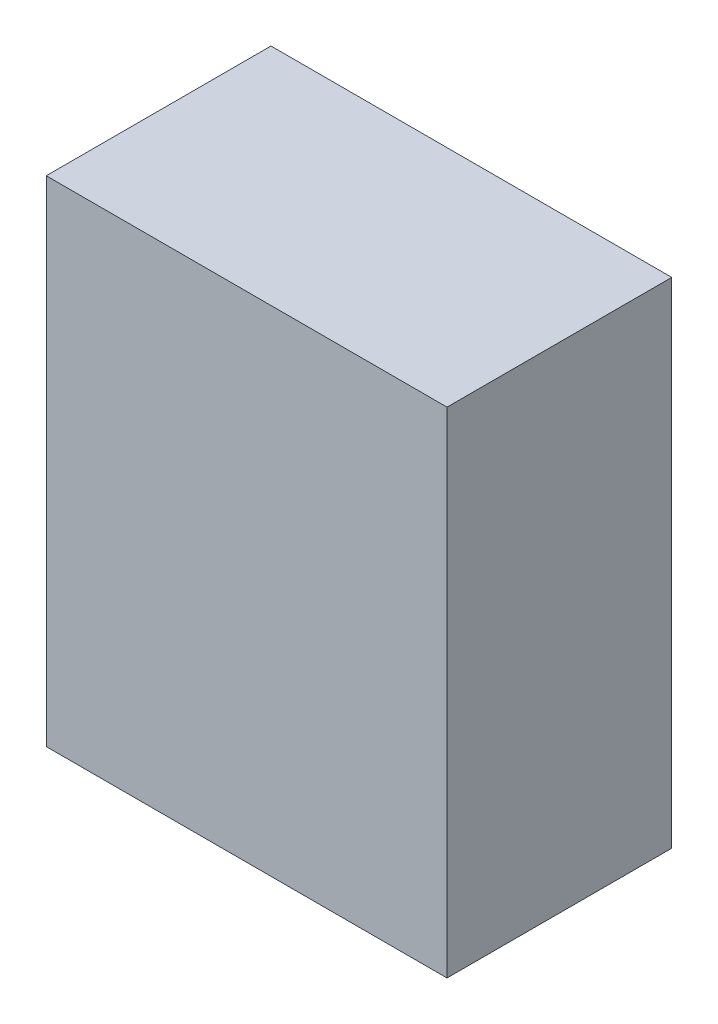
ISO-10303-21;
HEADER;
FILE_DESCRIPTION(('STEP AP214'),'2;1');
FILE_NAME('part.step','',(''),(''),'','','');
FILE_SCHEMA(('AUTOMOTIVE_DESIGN { 1 0 10303 214 1 1 1 1 }'));
ENDSEC;
DATA;
#1=APPLICATION_CONTEXT('core data for automotive mechanical design processes');
#2=APPLICATION_PROTOCOL_DEFINITION('international standard','automotive_design',2000,#1);
#3=PRODUCT_CONTEXT('',#1,'mechanical');
#4=PRODUCT('Part','Part','',(#3));
#5=PRODUCT_RELATED_PRODUCT_CATEGORY('part','',(#4));
#6=PRODUCT_DEFINITION_FORMATION('','',#4);
#7=PRODUCT_DEFINITION_CONTEXT('part definition',#1,'design');
#8=PRODUCT_DEFINITION('design','',#6,#7);
#9=PRODUCT_DEFINITION_SHAPE('','',#8);
#10=(LENGTH_UNIT() NAMED_UNIT(*) SI_UNIT(.MILLI.,.METRE.));
#11=(NAMED_UNIT(*) PLANE_ANGLE_UNIT() SI_UNIT($,.RADIAN.));
#12=(NAMED_UNIT(*) SI_UNIT($,.STERADIAN.) SOLID_ANGLE_UNIT());
#13=UNCERTAINTY_MEASURE_WITH_UNIT(LENGTH_MEASURE(1.E-05),#10,'distance_accuracy_value','');
#14=(GEOMETRIC_REPRESENTATION_CONTEXT(3) GLOBAL_UNCERTAINTY_ASSIGNED_CONTEXT((#13)) GLOBAL_UNIT_ASSIGNED_CONTEXT((#10,
#11,#12)) REPRESENTATION_CONTEXT('',''));
#15=CARTESIAN_POINT('',(0.,0.,0.));
#16=DIRECTION('',(0.,0.,1.));
#17=DIRECTION('',(1.,0.,0.));
#18=AXIS2_PLACEMENT_3D('',#15,#16,#17);
#19=CARTESIAN_POINT('',(-0.53499999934,0.6600000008,0.59999999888));
#20=DIRECTION('',(1.,0.,0.));
#21=DIRECTION('',(0.,0.,-1.));
#22=AXIS2_PLACEMENT_3D('',#19,#20,#21);
#23=PLANE('',#22);
#24=DIRECTION('',(0.,-1.,0.));
#25=VECTOR('',#24,1.);
#26=CARTESIAN_POINT('',(-0.53499999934,0.6600000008,0.));
#27=LINE('',#26,#25);
#28=CARTESIAN_POINT('',(-0.53499999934,0.6600000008,0.));
#29=VERTEX_POINT('',#28);
#30=CARTESIAN_POINT('',(-0.53499999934,-0.6600000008,0.));
#31=VERTEX_POINT('',#30);
#32=EDGE_CURVE('E96',#29,#31,#27,.T.);
#33=ORIENTED_EDGE('',*,*,#32,.T.);
#34=DIRECTION('',(0.,0.,-1.));
#35=VECTOR('',#34,1.);
#36=CARTESIAN_POINT('',(-0.53499999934,-0.6600000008,0.59999999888));
#37=LINE('',#36,#35);
#38=CARTESIAN_POINT('',(-0.53499999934,-0.6600000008,0.59999999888));
#39=VERTEX_POINT('',#38);
#40=EDGE_CURVE('E11',#39,#31,#37,.T.);
#41=ORIENTED_EDGE('',*,*,#40,.F.);
#42=DIRECTION('',(0.,-1.,0.));
#43=VECTOR('',#42,1.);
#44=CARTESIAN_POINT('',(-0.53499999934,0.6600000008,0.59999999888));
#45=LINE('',#44,#43);
#46=CARTESIAN_POINT('',(-0.53499999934,0.6600000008,0.59999999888));
#47=VERTEX_POINT('',#46);
#48=EDGE_CURVE('E84',#47,#39,#45,.T.);
#49=ORIENTED_EDGE('',*,*,#48,.F.);
#50=DIRECTION('',(0.,0.,-1.));
#51=VECTOR('',#50,1.);
#52=CARTESIAN_POINT('',(-0.53499999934,0.6600000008,0.59999999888));
#53=LINE('',#52,#51);
#54=EDGE_CURVE('E92',#47,#29,#53,.T.);
#55=ORIENTED_EDGE('',*,*,#54,.T.);
#56=EDGE_LOOP('',(#33,#41,#49,#55));
#57=FACE_BOUND('',#56,.T.);
#58=ADVANCED_FACE('F33',(#57),#23,.F.);
#59=CARTESIAN_POINT('',(-0.53499999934,-0.6600000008,0.59999999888));
#60=DIRECTION('',(0.,1.,0.));
#61=DIRECTION('',(0.,0.,1.));
#62=AXIS2_PLACEMENT_3D('',#59,#60,#61);
#63=PLANE('',#62);
#64=DIRECTION('',(1.,0.,0.));
#65=VECTOR('',#64,1.);
#66=CARTESIAN_POINT('',(-0.53499999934,-0.6600000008,0.));
#67=LINE('',#66,#65);
#68=CARTESIAN_POINT('',(0.53499999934,-0.6600000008,0.));
#69=VERTEX_POINT('',#68);
#70=EDGE_CURVE('E88',#31,#69,#67,.T.);
#71=ORIENTED_EDGE('',*,*,#70,.T.);
#72=DIRECTION('',(0.,0.,-1.));
#73=VECTOR('',#72,1.);
#74=CARTESIAN_POINT('',(0.53499999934,-0.6600000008,0.59999999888));
#75=LINE('',#74,#73);
#76=CARTESIAN_POINT('',(0.53499999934,-0.6600000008,0.59999999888));
#77=VERTEX_POINT('',#76);
#78=EDGE_CURVE('E41',#77,#69,#75,.T.);
#79=ORIENTED_EDGE('',*,*,#78,.F.);
#80=DIRECTION('',(1.,0.,0.));
#81=VECTOR('',#80,1.);
#82=CARTESIAN_POINT('',(-0.53499999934,-0.6600000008,0.59999999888));
#83=LINE('',#82,#81);
#84=EDGE_CURVE('E79',#39,#77,#83,.T.);
#85=ORIENTED_EDGE('',*,*,#84,.F.);
#86=ORIENTED_EDGE('',*,*,#40,.T.);
#87=EDGE_LOOP('',(#71,#79,#85,#86));
#88=FACE_BOUND('',#87,.T.);
#89=ADVANCED_FACE('F87',(#88),#63,.F.);
#90=CARTESIAN_POINT('',(0.53499999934,-0.6600000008,0.59999999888));
#91=DIRECTION('',(-1.,0.,0.));
#92=DIRECTION('',(0.,0.,1.));
#93=AXIS2_PLACEMENT_3D('',#90,#91,#92);
#94=PLANE('',#93);
#95=DIRECTION('',(0.,1.,0.));
#96=VECTOR('',#95,1.);
#97=CARTESIAN_POINT('',(0.53499999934,-0.6600000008,0.));
#98=LINE('',#97,#96);
#99=CARTESIAN_POINT('',(0.53499999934,0.6600000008,0.));
#100=VERTEX_POINT('',#99);
#101=EDGE_CURVE('E66',#69,#100,#98,.T.);
#102=ORIENTED_EDGE('',*,*,#101,.T.);
#103=DIRECTION('',(0.,0.,-1.));
#104=VECTOR('',#103,1.);
#105=CARTESIAN_POINT('',(0.53499999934,0.6600000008,0.59999999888));
#106=LINE('',#105,#104);
#107=CARTESIAN_POINT('',(0.53499999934,0.6600000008,0.59999999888));
#108=VERTEX_POINT('',#107);
#109=EDGE_CURVE('E89',#108,#100,#106,.T.);
#110=ORIENTED_EDGE('',*,*,#109,.F.);
#111=DIRECTION('',(0.,1.,0.));
#112=VECTOR('',#111,1.);
#113=CARTESIAN_POINT('',(0.53499999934,-0.6600000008,0.59999999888));
#114=LINE('',#113,#112);
#115=EDGE_CURVE('E82',#77,#108,#114,.T.);
#116=ORIENTED_EDGE('',*,*,#115,.F.);
#117=ORIENTED_EDGE('',*,*,#78,.T.);
#118=EDGE_LOOP('',(#102,#110,#116,#117));
#119=FACE_BOUND('',#118,.T.);
#120=ADVANCED_FACE('F90',(#119),#94,.F.);
#121=CARTESIAN_POINT('',(0.53499999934,0.6600000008,0.59999999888));
#122=DIRECTION('',(0.,-1.,0.));
#123=DIRECTION('',(0.,0.,-1.));
#124=AXIS2_PLACEMENT_3D('',#121,#122,#123);
#125=PLANE('',#124);
#126=DIRECTION('',(-1.,0.,0.));
#127=VECTOR('',#126,1.);
#128=CARTESIAN_POINT('',(0.53499999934,0.6600000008,0.));
#129=LINE('',#128,#127);
#130=EDGE_CURVE('E72',#100,#29,#129,.T.);
#131=ORIENTED_EDGE('',*,*,#130,.T.);
#132=ORIENTED_EDGE('',*,*,#54,.F.);
#133=DIRECTION('',(-1.,0.,0.));
#134=VECTOR('',#133,1.);
#135=CARTESIAN_POINT('',(0.53499999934,0.6600000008,0.59999999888));
#136=LINE('',#135,#134);
#137=EDGE_CURVE('E49',#108,#47,#136,.T.);
#138=ORIENTED_EDGE('',*,*,#137,.F.);
#139=ORIENTED_EDGE('',*,*,#109,.T.);
#140=EDGE_LOOP('',(#131,#132,#138,#139));
#141=FACE_BOUND('',#140,.T.);
#142=ADVANCED_FACE('F103',(#141),#125,.F.);
#143=CARTESIAN_POINT('',(0.,0.,0.59999999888));
#144=DIRECTION('',(0.,0.,1.));
#145=DIRECTION('',(1.,0.,0.));
#146=AXIS2_PLACEMENT_3D('',#143,#144,#145);
#147=PLANE('',#146);
#148=ORIENTED_EDGE('',*,*,#48,.T.);
#149=ORIENTED_EDGE('',*,*,#84,.T.);
#150=ORIENTED_EDGE('',*,*,#115,.T.);
#151=ORIENTED_EDGE('',*,*,#137,.T.);
#152=EDGE_LOOP('',(#148,#149,#150,#151));
#153=FACE_BOUND('',#152,.T.);
#154=ADVANCED_FACE('F80',(#153),#147,.T.);
#155=CARTESIAN_POINT('',(0.,0.,0.));
#156=DIRECTION('',(0.,0.,1.));
#157=DIRECTION('',(1.,0.,0.));
#158=AXIS2_PLACEMENT_3D('',#155,#156,#157);
#159=PLANE('',#158);
#160=ORIENTED_EDGE('',*,*,#32,.F.);
#161=ORIENTED_EDGE('',*,*,#130,.F.);
#162=ORIENTED_EDGE('',*,*,#101,.F.);
#163=ORIENTED_EDGE('',*,*,#70,.F.);
#164=EDGE_LOOP('',(#160,#161,#162,#163));
#165=FACE_BOUND('',#164,.T.);
#166=ADVANCED_FACE('F106',(#165),#159,.F.);
#167=CLOSED_SHELL('',(#58,#89,#120,#142,#154,#166));
#168=MANIFOLD_SOLID_BREP('B2',#167);
#169=ADVANCED_BREP_SHAPE_REPRESENTATION('',(#18,#168),#14);
#170=SHAPE_DEFINITION_REPRESENTATION(#9,#169);
ENDSEC;
END-ISO-10303-21;
